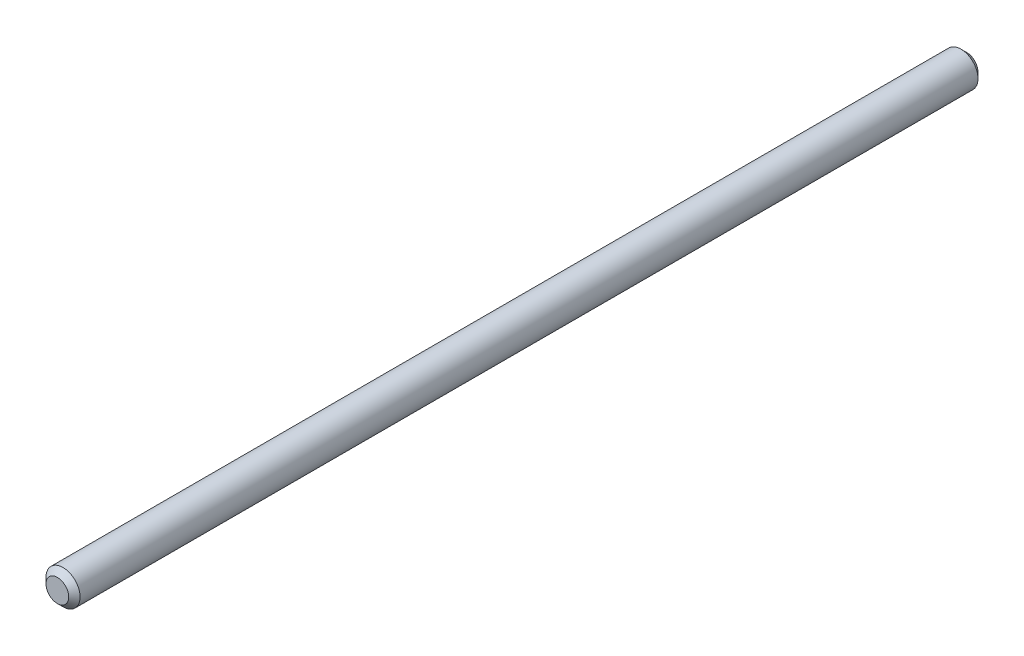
from build123d import *

# Parameters (mm, degrees)
ESQUISSE1_R          = 1.5
BASE_EXTRUSION_DEPTH = 80
CHANFREIN1_SIZE      = 0.5


with BuildPart() as part:
    # Esquisse1 → Base-Extrusion (new body)
    with BuildSketch(Plane.XY):
        Circle(ESQUISSE1_R)
    extrude(amount=BASE_EXTRUSION_DEPTH)

    # Chanfrein1
    chanfrein1_edges = [part.edges().sort_by_distance(p)[0] for p in [
        (-1.5, 0, 0),
        (-1.5, 0, 80),
    ]]
    chamfer(chanfrein1_edges, length=CHANFREIN1_SIZE)


solid = part.part
